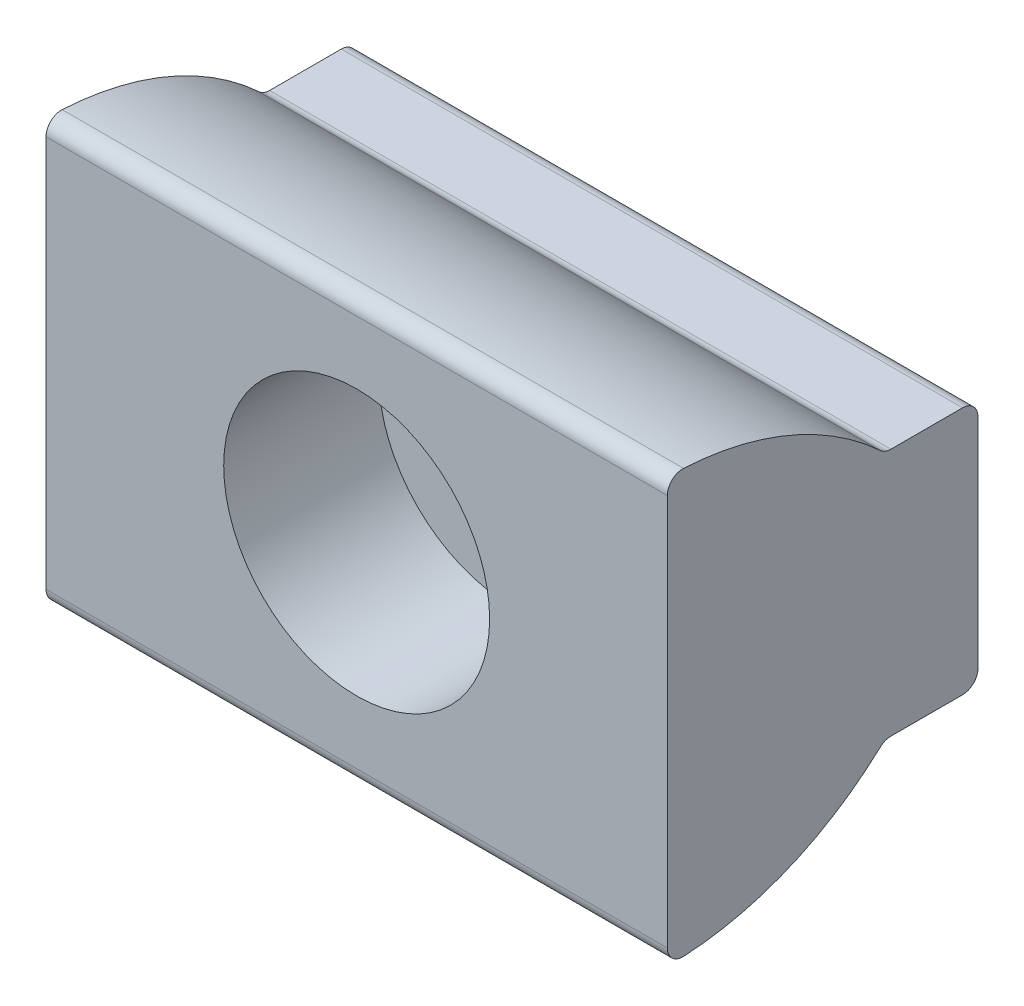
ISO-10303-21;
HEADER;
FILE_DESCRIPTION(('STEP AP214'),'2;1');
FILE_NAME('part.step','',(''),(''),'','','');
FILE_SCHEMA(('AUTOMOTIVE_DESIGN { 1 0 10303 214 1 1 1 1 }'));
ENDSEC;
DATA;
#1=APPLICATION_CONTEXT('core data for automotive mechanical design processes');
#2=APPLICATION_PROTOCOL_DEFINITION('international standard','automotive_design',2000,#1);
#3=PRODUCT_CONTEXT('',#1,'mechanical');
#4=PRODUCT('Part','Part','',(#3));
#5=PRODUCT_RELATED_PRODUCT_CATEGORY('part','',(#4));
#6=PRODUCT_DEFINITION_FORMATION('','',#4);
#7=PRODUCT_DEFINITION_CONTEXT('part definition',#1,'design');
#8=PRODUCT_DEFINITION('design','',#6,#7);
#9=PRODUCT_DEFINITION_SHAPE('','',#8);
#10=(LENGTH_UNIT() NAMED_UNIT(*) SI_UNIT(.MILLI.,.METRE.));
#11=(NAMED_UNIT(*) PLANE_ANGLE_UNIT() SI_UNIT($,.RADIAN.));
#12=(NAMED_UNIT(*) SI_UNIT($,.STERADIAN.) SOLID_ANGLE_UNIT());
#13=UNCERTAINTY_MEASURE_WITH_UNIT(LENGTH_MEASURE(1.E-05),#10,'distance_accuracy_value','');
#14=(GEOMETRIC_REPRESENTATION_CONTEXT(3) GLOBAL_UNCERTAINTY_ASSIGNED_CONTEXT((#13)) GLOBAL_UNIT_ASSIGNED_CONTEXT((#10,
#11,#12)) REPRESENTATION_CONTEXT('',''));
#15=CARTESIAN_POINT('',(0.,0.,0.));
#16=DIRECTION('',(0.,0.,1.));
#17=DIRECTION('',(1.,0.,0.));
#18=AXIS2_PLACEMENT_3D('',#15,#16,#17);
#19=CARTESIAN_POINT('',(15.875,-5.5626,0.));
#20=DIRECTION('',(0.,0.,1.));
#21=DIRECTION('',(1.,0.,0.));
#22=AXIS2_PLACEMENT_3D('',#19,#20,#21);
#23=PLANE('',#22);
#24=DIRECTION('',(0.,1.,0.));
#25=VECTOR('',#24,1.);
#26=CARTESIAN_POINT('',(-15.875,-5.5626,0.));
#27=LINE('',#26,#25);
#28=CARTESIAN_POINT('',(-15.875,-5.5626,0.));
#29=VERTEX_POINT('',#28);
#30=CARTESIAN_POINT('',(-15.875,5.5626,0.));
#31=VERTEX_POINT('',#30);
#32=EDGE_CURVE('E135',#29,#31,#27,.T.);
#33=ORIENTED_EDGE('',*,*,#32,.T.);
#34=DIRECTION('',(-1.,0.,0.));
#35=VECTOR('',#34,1.);
#36=CARTESIAN_POINT('',(15.875,5.5626,0.));
#37=LINE('',#36,#35);
#38=CARTESIAN_POINT('',(15.875,5.5626,0.));
#39=VERTEX_POINT('',#38);
#40=EDGE_CURVE('E186',#39,#31,#37,.T.);
#41=ORIENTED_EDGE('',*,*,#40,.F.);
#42=DIRECTION('',(0.,1.,0.));
#43=VECTOR('',#42,1.);
#44=CARTESIAN_POINT('',(15.875,-5.5626,0.));
#45=LINE('',#44,#43);
#46=CARTESIAN_POINT('',(15.875,-5.5626,0.));
#47=VERTEX_POINT('',#46);
#48=EDGE_CURVE('E158',#47,#39,#45,.T.);
#49=ORIENTED_EDGE('',*,*,#48,.F.);
#50=DIRECTION('',(-1.,0.,0.));
#51=VECTOR('',#50,1.);
#52=CARTESIAN_POINT('',(15.875,-5.5626,0.));
#53=LINE('',#52,#51);
#54=EDGE_CURVE('E189',#47,#29,#53,.T.);
#55=ORIENTED_EDGE('',*,*,#54,.T.);
#56=EDGE_LOOP('',(#33,#41,#49,#55));
#57=FACE_BOUND('',#56,.T.);
#58=CARTESIAN_POINT('',(0.,0.,0.));
#59=DIRECTION('',(0.,0.,1.));
#60=DIRECTION('',(1.,0.,0.));
#61=AXIS2_PLACEMENT_3D('',#58,#59,#60);
#62=CIRCLE('',#61,4.1656);
#63=CARTESIAN_POINT('',(4.1656,0.,0.));
#64=VERTEX_POINT('',#63);
#65=EDGE_CURVE('E18',#64,#64,#62,.F.);
#66=ORIENTED_EDGE('',*,*,#65,.F.);
#67=EDGE_LOOP('',(#66));
#68=FACE_BOUND('',#67,.T.);
#69=ADVANCED_FACE('F14',(#57,#68),#23,.F.);
#70=CARTESIAN_POINT('',(15.875,-10.0126712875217,15.875));
#71=DIRECTION('',(0.,0.,-1.));
#72=DIRECTION('',(-1.,0.,0.));
#73=AXIS2_PLACEMENT_3D('',#70,#71,#72);
#74=PLANE('',#73);
#75=DIRECTION('',(0.,-1.,0.));
#76=VECTOR('',#75,1.);
#77=CARTESIAN_POINT('',(-15.875,-10.0126712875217,15.875));
#78=LINE('',#77,#76);
#79=CARTESIAN_POINT('',(-15.875,10.0126712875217,15.875));
#80=VERTEX_POINT('',#79);
#81=CARTESIAN_POINT('',(-15.875,-10.0126712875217,15.875));
#82=VERTEX_POINT('',#81);
#83=EDGE_CURVE('E147',#80,#82,#78,.T.);
#84=ORIENTED_EDGE('',*,*,#83,.T.);
#85=DIRECTION('',(-1.,0.,0.));
#86=VECTOR('',#85,1.);
#87=CARTESIAN_POINT('',(15.875,-10.0126712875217,15.875));
#88=LINE('',#87,#86);
#89=CARTESIAN_POINT('',(15.875,-10.0126712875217,15.875));
#90=VERTEX_POINT('',#89);
#91=EDGE_CURVE('E122',#90,#82,#88,.T.);
#92=ORIENTED_EDGE('',*,*,#91,.F.);
#93=DIRECTION('',(0.,-1.,0.));
#94=VECTOR('',#93,1.);
#95=CARTESIAN_POINT('',(15.875,-10.0126712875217,15.875));
#96=LINE('',#95,#94);
#97=CARTESIAN_POINT('',(15.875,10.0126712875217,15.875));
#98=VERTEX_POINT('',#97);
#99=EDGE_CURVE('E31',#98,#90,#96,.T.);
#100=ORIENTED_EDGE('',*,*,#99,.F.);
#101=DIRECTION('',(-1.,0.,0.));
#102=VECTOR('',#101,1.);
#103=CARTESIAN_POINT('',(15.875,10.0126712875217,15.875));
#104=LINE('',#103,#102);
#105=EDGE_CURVE('E171',#98,#80,#104,.T.);
#106=ORIENTED_EDGE('',*,*,#105,.T.);
#107=EDGE_LOOP('',(#84,#92,#100,#106));
#108=FACE_BOUND('',#107,.T.);
#109=CARTESIAN_POINT('',(0.,0.,15.875));
#110=DIRECTION('',(0.,0.,-1.));
#111=DIRECTION('',(-1.,0.,0.));
#112=AXIS2_PLACEMENT_3D('',#109,#110,#111);
#113=CIRCLE('',#112,6.7945);
#114=CARTESIAN_POINT('',(-6.7945,0.,15.875));
#115=VERTEX_POINT('',#114);
#116=EDGE_CURVE('E125',#115,#115,#113,.F.);
#117=ORIENTED_EDGE('',*,*,#116,.F.);
#118=EDGE_LOOP('',(#117));
#119=FACE_BOUND('',#118,.T.);
#120=ADVANCED_FACE('F224',(#108,#119),#74,.F.);
#121=CARTESIAN_POINT('',(15.875,-10.0126712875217,15.0876));
#122=DIRECTION('',(-1.,0.,0.));
#123=DIRECTION('',(0.,-1.,0.));
#124=AXIS2_PLACEMENT_3D('',#121,#122,#123);
#125=CYLINDRICAL_SURFACE('',#124,0.7874);
#126=CARTESIAN_POINT('',(-15.875,-10.0126712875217,15.0876));
#127=DIRECTION('',(1.,0.,0.));
#128=DIRECTION('',(0.,-1.,0.));
#129=AXIS2_PLACEMENT_3D('',#126,#127,#128);
#130=CIRCLE('',#129,0.7874);
#131=CARTESIAN_POINT('',(-15.875,-10.7990223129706,15.0469696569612));
#132=VERTEX_POINT('',#131);
#133=EDGE_CURVE('E109',#82,#132,#130,.T.);
#134=ORIENTED_EDGE('',*,*,#133,.T.);
#135=DIRECTION('',(-1.,0.,0.));
#136=VECTOR('',#135,1.);
#137=CARTESIAN_POINT('',(15.875,-10.7990223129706,15.0469696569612));
#138=LINE('',#137,#136);
#139=CARTESIAN_POINT('',(15.875,-10.7990223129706,15.0469696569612));
#140=VERTEX_POINT('',#139);
#141=EDGE_CURVE('E9',#140,#132,#138,.T.);
#142=ORIENTED_EDGE('',*,*,#141,.F.);
#143=CARTESIAN_POINT('',(15.875,-10.0126712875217,15.0876));
#144=DIRECTION('',(1.,0.,0.));
#145=DIRECTION('',(0.,-1.,0.));
#146=AXIS2_PLACEMENT_3D('',#143,#144,#145);
#147=CIRCLE('',#146,0.7874);
#148=EDGE_CURVE('E149',#90,#140,#147,.T.);
#149=ORIENTED_EDGE('',*,*,#148,.F.);
#150=ORIENTED_EDGE('',*,*,#91,.T.);
#151=EDGE_LOOP('',(#134,#142,#149,#150));
#152=FACE_BOUND('',#151,.T.);
#153=ADVANCED_FACE('F16',(#152),#125,.T.);
#154=CARTESIAN_POINT('',(15.875,5.22650099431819,15.875));
#155=DIRECTION('',(-1.,0.,0.));
#156=DIRECTION('',(0.,-1.,0.));
#157=AXIS2_PLACEMENT_3D('',#154,#155,#156);
#158=CYLINDRICAL_SURFACE('',#157,16.0469009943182);
#159=CARTESIAN_POINT('',(-15.875,5.22650099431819,15.875));
#160=DIRECTION('',(1.,0.,0.));
#161=DIRECTION('',(0.,1.,0.));
#162=AXIS2_PLACEMENT_3D('',#159,#160,#161);
#163=CIRCLE('',#162,16.0469009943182);
#164=CARTESIAN_POINT('',(-15.875,-6.55909647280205,4.98451223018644));
#165=VERTEX_POINT('',#164);
#166=EDGE_CURVE('E105',#132,#165,#163,.T.);
#167=ORIENTED_EDGE('',*,*,#166,.T.);
#168=DIRECTION('',(-1.,0.,0.));
#169=VECTOR('',#168,1.);
#170=CARTESIAN_POINT('',(15.875,-6.55909647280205,4.98451223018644));
#171=LINE('',#170,#169);
#172=CARTESIAN_POINT('',(15.875,-6.55909647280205,4.98451223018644));
#173=VERTEX_POINT('',#172);
#174=EDGE_CURVE('E23',#173,#165,#171,.T.);
#175=ORIENTED_EDGE('',*,*,#174,.F.);
#176=CARTESIAN_POINT('',(15.875,5.22650099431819,15.875));
#177=DIRECTION('',(1.,0.,0.));
#178=DIRECTION('',(0.,1.,0.));
#179=AXIS2_PLACEMENT_3D('',#176,#177,#178);
#180=CIRCLE('',#179,16.0469009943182);
#181=EDGE_CURVE('E118',#140,#173,#180,.T.);
#182=ORIENTED_EDGE('',*,*,#181,.F.);
#183=ORIENTED_EDGE('',*,*,#141,.T.);
#184=EDGE_LOOP('',(#167,#175,#182,#183));
#185=FACE_BOUND('',#184,.T.);
#186=ADVANCED_FACE('F117',(#185),#158,.T.);
#187=CARTESIAN_POINT('',(15.875,-7.1374,4.45013054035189));
#188=DIRECTION('',(-1.,0.,0.));
#189=DIRECTION('',(0.,-1.,0.));
#190=AXIS2_PLACEMENT_3D('',#187,#188,#189);
#191=CYLINDRICAL_SURFACE('',#190,0.7874);
#192=CARTESIAN_POINT('',(-15.875,-7.1374,4.45013054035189));
#193=DIRECTION('',(-1.,0.,0.));
#194=DIRECTION('',(0.,-1.,0.));
#195=AXIS2_PLACEMENT_3D('',#192,#193,#194);
#196=CIRCLE('',#195,0.7874);
#197=CARTESIAN_POINT('',(-15.875,-6.35,4.45013054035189));
#198=VERTEX_POINT('',#197);
#199=EDGE_CURVE('E111',#165,#198,#196,.T.);
#200=ORIENTED_EDGE('',*,*,#199,.T.);
#201=DIRECTION('',(-1.,0.,0.));
#202=VECTOR('',#201,1.);
#203=CARTESIAN_POINT('',(15.875,-6.35,4.45013054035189));
#204=LINE('',#203,#202);
#205=CARTESIAN_POINT('',(15.875,-6.35,4.45013054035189));
#206=VERTEX_POINT('',#205);
#207=EDGE_CURVE('E195',#206,#198,#204,.T.);
#208=ORIENTED_EDGE('',*,*,#207,.F.);
#209=CARTESIAN_POINT('',(15.875,-7.1374,4.45013054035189));
#210=DIRECTION('',(-1.,0.,0.));
#211=DIRECTION('',(0.,-1.,0.));
#212=AXIS2_PLACEMENT_3D('',#209,#210,#211);
#213=CIRCLE('',#212,0.7874);
#214=EDGE_CURVE('E152',#173,#206,#213,.T.);
#215=ORIENTED_EDGE('',*,*,#214,.F.);
#216=ORIENTED_EDGE('',*,*,#174,.T.);
#217=EDGE_LOOP('',(#200,#208,#215,#216));
#218=FACE_BOUND('',#217,.T.);
#219=ADVANCED_FACE('F245',(#218),#191,.F.);
#220=CARTESIAN_POINT('',(15.875,-6.35,0.7874));
#221=DIRECTION('',(0.,1.,0.));
#222=DIRECTION('',(-1.,0.,0.));
#223=AXIS2_PLACEMENT_3D('',#220,#221,#222);
#224=PLANE('',#223);
#225=DIRECTION('',(0.,0.,-1.));
#226=VECTOR('',#225,1.);
#227=CARTESIAN_POINT('',(-15.875,-6.35,0.7874));
#228=LINE('',#227,#226);
#229=CARTESIAN_POINT('',(-15.875,-6.35,0.7874));
#230=VERTEX_POINT('',#229);
#231=EDGE_CURVE('E131',#198,#230,#228,.T.);
#232=ORIENTED_EDGE('',*,*,#231,.T.);
#233=DIRECTION('',(-1.,0.,0.));
#234=VECTOR('',#233,1.);
#235=CARTESIAN_POINT('',(15.875,-6.35,0.7874));
#236=LINE('',#235,#234);
#237=CARTESIAN_POINT('',(15.875,-6.35,0.7874));
#238=VERTEX_POINT('',#237);
#239=EDGE_CURVE('E192',#238,#230,#236,.T.);
#240=ORIENTED_EDGE('',*,*,#239,.F.);
#241=DIRECTION('',(0.,0.,-1.));
#242=VECTOR('',#241,1.);
#243=CARTESIAN_POINT('',(15.875,-6.35,0.7874));
#244=LINE('',#243,#242);
#245=EDGE_CURVE('E154',#206,#238,#244,.T.);
#246=ORIENTED_EDGE('',*,*,#245,.F.);
#247=ORIENTED_EDGE('',*,*,#207,.T.);
#248=EDGE_LOOP('',(#232,#240,#246,#247));
#249=FACE_BOUND('',#248,.T.);
#250=ADVANCED_FACE('F241',(#249),#224,.F.);
#251=CARTESIAN_POINT('',(15.875,-5.5626,0.7874));
#252=DIRECTION('',(-1.,0.,0.));
#253=DIRECTION('',(0.,-1.,0.));
#254=AXIS2_PLACEMENT_3D('',#251,#252,#253);
#255=CYLINDRICAL_SURFACE('',#254,0.7874);
#256=CARTESIAN_POINT('',(-15.875,-5.5626,0.7874));
#257=DIRECTION('',(1.,0.,0.));
#258=DIRECTION('',(0.,1.,0.));
#259=AXIS2_PLACEMENT_3D('',#256,#257,#258);
#260=CIRCLE('',#259,0.7874);
#261=EDGE_CURVE('E133',#230,#29,#260,.T.);
#262=ORIENTED_EDGE('',*,*,#261,.T.);
#263=ORIENTED_EDGE('',*,*,#54,.F.);
#264=CARTESIAN_POINT('',(15.875,-5.5626,0.7874));
#265=DIRECTION('',(1.,0.,0.));
#266=DIRECTION('',(0.,1.,0.));
#267=AXIS2_PLACEMENT_3D('',#264,#265,#266);
#268=CIRCLE('',#267,0.7874);
#269=EDGE_CURVE('E156',#238,#47,#268,.T.);
#270=ORIENTED_EDGE('',*,*,#269,.F.);
#271=ORIENTED_EDGE('',*,*,#239,.T.);
#272=EDGE_LOOP('',(#262,#263,#270,#271));
#273=FACE_BOUND('',#272,.T.);
#274=ADVANCED_FACE('F238',(#273),#255,.T.);
#275=CARTESIAN_POINT('',(15.875,5.5626,0.7874));
#276=DIRECTION('',(-1.,0.,0.));
#277=DIRECTION('',(0.,-1.,0.));
#278=AXIS2_PLACEMENT_3D('',#275,#276,#277);
#279=CYLINDRICAL_SURFACE('',#278,0.7874);
#280=CARTESIAN_POINT('',(-15.875,5.5626,0.7874));
#281=DIRECTION('',(1.,0.,0.));
#282=DIRECTION('',(0.,1.,0.));
#283=AXIS2_PLACEMENT_3D('',#280,#281,#282);
#284=CIRCLE('',#283,0.7874);
#285=CARTESIAN_POINT('',(-15.875,6.35,0.7874));
#286=VERTEX_POINT('',#285);
#287=EDGE_CURVE('E137',#31,#286,#284,.T.);
#288=ORIENTED_EDGE('',*,*,#287,.T.);
#289=DIRECTION('',(-1.,0.,0.));
#290=VECTOR('',#289,1.);
#291=CARTESIAN_POINT('',(15.875,6.35,0.7874));
#292=LINE('',#291,#290);
#293=CARTESIAN_POINT('',(15.875,6.35,0.7874));
#294=VERTEX_POINT('',#293);
#295=EDGE_CURVE('E183',#294,#286,#292,.T.);
#296=ORIENTED_EDGE('',*,*,#295,.F.);
#297=CARTESIAN_POINT('',(15.875,5.5626,0.7874));
#298=DIRECTION('',(1.,0.,0.));
#299=DIRECTION('',(0.,1.,0.));
#300=AXIS2_PLACEMENT_3D('',#297,#298,#299);
#301=CIRCLE('',#300,0.7874);
#302=EDGE_CURVE('E160',#39,#294,#301,.T.);
#303=ORIENTED_EDGE('',*,*,#302,.F.);
#304=ORIENTED_EDGE('',*,*,#40,.T.);
#305=EDGE_LOOP('',(#288,#296,#303,#304));
#306=FACE_BOUND('',#305,.T.);
#307=ADVANCED_FACE('F236',(#306),#279,.T.);
#308=CARTESIAN_POINT('',(15.875,6.35,0.7874));
#309=DIRECTION('',(0.,-1.,0.));
#310=DIRECTION('',(1.,0.,0.));
#311=AXIS2_PLACEMENT_3D('',#308,#309,#310);
#312=PLANE('',#311);
#313=DIRECTION('',(0.,0.,1.));
#314=VECTOR('',#313,1.);
#315=CARTESIAN_POINT('',(-15.875,6.35,0.7874));
#316=LINE('',#315,#314);
#317=CARTESIAN_POINT('',(-15.875,6.35,4.45013054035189));
#318=VERTEX_POINT('',#317);
#319=EDGE_CURVE('E139',#286,#318,#316,.T.);
#320=ORIENTED_EDGE('',*,*,#319,.T.);
#321=DIRECTION('',(-1.,0.,0.));
#322=VECTOR('',#321,1.);
#323=CARTESIAN_POINT('',(15.875,6.35,4.45013054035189));
#324=LINE('',#323,#322);
#325=CARTESIAN_POINT('',(15.875,6.35,4.45013054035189));
#326=VERTEX_POINT('',#325);
#327=EDGE_CURVE('E180',#326,#318,#324,.T.);
#328=ORIENTED_EDGE('',*,*,#327,.F.);
#329=DIRECTION('',(0.,0.,1.));
#330=VECTOR('',#329,1.);
#331=CARTESIAN_POINT('',(15.875,6.35,0.7874));
#332=LINE('',#331,#330);
#333=EDGE_CURVE('E162',#294,#326,#332,.T.);
#334=ORIENTED_EDGE('',*,*,#333,.F.);
#335=ORIENTED_EDGE('',*,*,#295,.T.);
#336=EDGE_LOOP('',(#320,#328,#334,#335));
#337=FACE_BOUND('',#336,.T.);
#338=ADVANCED_FACE('F303',(#337),#312,.F.);
#339=CARTESIAN_POINT('',(15.875,7.1374,4.45013054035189));
#340=DIRECTION('',(-1.,0.,0.));
#341=DIRECTION('',(0.,-1.,0.));
#342=AXIS2_PLACEMENT_3D('',#339,#340,#341);
#343=CYLINDRICAL_SURFACE('',#342,0.7874);
#344=CARTESIAN_POINT('',(-15.875,7.1374,4.45013054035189));
#345=DIRECTION('',(-1.,0.,0.));
#346=DIRECTION('',(0.,-1.,0.));
#347=AXIS2_PLACEMENT_3D('',#344,#345,#346);
#348=CIRCLE('',#347,0.7874);
#349=CARTESIAN_POINT('',(-15.875,6.55909647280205,4.98451223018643));
#350=VERTEX_POINT('',#349);
#351=EDGE_CURVE('E141',#318,#350,#348,.T.);
#352=ORIENTED_EDGE('',*,*,#351,.T.);
#353=DIRECTION('',(-1.,0.,0.));
#354=VECTOR('',#353,1.);
#355=CARTESIAN_POINT('',(15.875,6.55909647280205,4.98451223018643));
#356=LINE('',#355,#354);
#357=CARTESIAN_POINT('',(15.875,6.55909647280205,4.98451223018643));
#358=VERTEX_POINT('',#357);
#359=EDGE_CURVE('E177',#358,#350,#356,.T.);
#360=ORIENTED_EDGE('',*,*,#359,.F.);
#361=CARTESIAN_POINT('',(15.875,7.1374,4.45013054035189));
#362=DIRECTION('',(-1.,0.,0.));
#363=DIRECTION('',(0.,-1.,0.));
#364=AXIS2_PLACEMENT_3D('',#361,#362,#363);
#365=CIRCLE('',#364,0.7874);
#366=EDGE_CURVE('E164',#326,#358,#365,.T.);
#367=ORIENTED_EDGE('',*,*,#366,.F.);
#368=ORIENTED_EDGE('',*,*,#327,.T.);
#369=EDGE_LOOP('',(#352,#360,#367,#368));
#370=FACE_BOUND('',#369,.T.);
#371=ADVANCED_FACE('F310',(#370),#343,.F.);
#372=CARTESIAN_POINT('',(15.875,-5.22650099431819,15.875));
#373=DIRECTION('',(-1.,0.,0.));
#374=DIRECTION('',(0.,-1.,0.));
#375=AXIS2_PLACEMENT_3D('',#372,#373,#374);
#376=CYLINDRICAL_SURFACE('',#375,16.0469009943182);
#377=CARTESIAN_POINT('',(-15.875,-5.22650099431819,15.875));
#378=DIRECTION('',(1.,0.,0.));
#379=DIRECTION('',(0.,-1.,0.));
#380=AXIS2_PLACEMENT_3D('',#377,#378,#379);
#381=CIRCLE('',#380,16.0469009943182);
#382=CARTESIAN_POINT('',(-15.875,10.7990223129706,15.0469696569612));
#383=VERTEX_POINT('',#382);
#384=EDGE_CURVE('E143',#350,#383,#381,.T.);
#385=ORIENTED_EDGE('',*,*,#384,.T.);
#386=DIRECTION('',(-1.,0.,0.));
#387=VECTOR('',#386,1.);
#388=CARTESIAN_POINT('',(15.875,10.7990223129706,15.0469696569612));
#389=LINE('',#388,#387);
#390=CARTESIAN_POINT('',(15.875,10.7990223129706,15.0469696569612));
#391=VERTEX_POINT('',#390);
#392=EDGE_CURVE('E174',#391,#383,#389,.T.);
#393=ORIENTED_EDGE('',*,*,#392,.F.);
#394=CARTESIAN_POINT('',(15.875,-5.22650099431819,15.875));
#395=DIRECTION('',(1.,0.,0.));
#396=DIRECTION('',(0.,-1.,0.));
#397=AXIS2_PLACEMENT_3D('',#394,#395,#396);
#398=CIRCLE('',#397,16.0469009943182);
#399=EDGE_CURVE('E166',#358,#391,#398,.T.);
#400=ORIENTED_EDGE('',*,*,#399,.F.);
#401=ORIENTED_EDGE('',*,*,#359,.T.);
#402=EDGE_LOOP('',(#385,#393,#400,#401));
#403=FACE_BOUND('',#402,.T.);
#404=ADVANCED_FACE('F318',(#403),#376,.T.);
#405=CARTESIAN_POINT('',(15.875,10.0126712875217,15.0876));
#406=DIRECTION('',(-1.,0.,0.));
#407=DIRECTION('',(0.,-1.,0.));
#408=AXIS2_PLACEMENT_3D('',#405,#406,#407);
#409=CYLINDRICAL_SURFACE('',#408,0.7874);
#410=CARTESIAN_POINT('',(-15.875,10.0126712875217,15.0876));
#411=DIRECTION('',(1.,0.,0.));
#412=DIRECTION('',(0.,-1.,0.));
#413=AXIS2_PLACEMENT_3D('',#410,#411,#412);
#414=CIRCLE('',#413,0.7874);
#415=EDGE_CURVE('E145',#383,#80,#414,.T.);
#416=ORIENTED_EDGE('',*,*,#415,.T.);
#417=ORIENTED_EDGE('',*,*,#105,.F.);
#418=CARTESIAN_POINT('',(15.875,10.0126712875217,15.0876));
#419=DIRECTION('',(1.,0.,0.));
#420=DIRECTION('',(0.,-1.,0.));
#421=AXIS2_PLACEMENT_3D('',#418,#419,#420);
#422=CIRCLE('',#421,0.7874);
#423=EDGE_CURVE('E36',#391,#98,#422,.T.);
#424=ORIENTED_EDGE('',*,*,#423,.F.);
#425=ORIENTED_EDGE('',*,*,#392,.T.);
#426=EDGE_LOOP('',(#416,#417,#424,#425));
#427=FACE_BOUND('',#426,.T.);
#428=ADVANCED_FACE('F327',(#427),#409,.T.);
#429=CARTESIAN_POINT('',(15.875,-10.0126712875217,15.0876));
#430=DIRECTION('',(-1.,0.,0.));
#431=DIRECTION('',(0.,-1.,0.));
#432=AXIS2_PLACEMENT_3D('',#429,#430,#431);
#433=PLANE('',#432);
#434=ORIENTED_EDGE('',*,*,#148,.T.);
#435=ORIENTED_EDGE('',*,*,#181,.T.);
#436=ORIENTED_EDGE('',*,*,#214,.T.);
#437=ORIENTED_EDGE('',*,*,#245,.T.);
#438=ORIENTED_EDGE('',*,*,#269,.T.);
#439=ORIENTED_EDGE('',*,*,#48,.T.);
#440=ORIENTED_EDGE('',*,*,#302,.T.);
#441=ORIENTED_EDGE('',*,*,#333,.T.);
#442=ORIENTED_EDGE('',*,*,#366,.T.);
#443=ORIENTED_EDGE('',*,*,#399,.T.);
#444=ORIENTED_EDGE('',*,*,#423,.T.);
#445=ORIENTED_EDGE('',*,*,#99,.T.);
#446=EDGE_LOOP('',(#434,#435,#436,#437,#438,#439,#440,#441,#442,#443,#444,#445));
#447=FACE_BOUND('',#446,.T.);
#448=ADVANCED_FACE('F336',(#447),#433,.F.);
#449=CARTESIAN_POINT('',(-15.875,-10.0126712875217,15.0876));
#450=DIRECTION('',(-1.,0.,0.));
#451=DIRECTION('',(0.,-1.,0.));
#452=AXIS2_PLACEMENT_3D('',#449,#450,#451);
#453=PLANE('',#452);
#454=ORIENTED_EDGE('',*,*,#133,.F.);
#455=ORIENTED_EDGE('',*,*,#83,.F.);
#456=ORIENTED_EDGE('',*,*,#415,.F.);
#457=ORIENTED_EDGE('',*,*,#384,.F.);
#458=ORIENTED_EDGE('',*,*,#351,.F.);
#459=ORIENTED_EDGE('',*,*,#319,.F.);
#460=ORIENTED_EDGE('',*,*,#287,.F.);
#461=ORIENTED_EDGE('',*,*,#32,.F.);
#462=ORIENTED_EDGE('',*,*,#261,.F.);
#463=ORIENTED_EDGE('',*,*,#231,.F.);
#464=ORIENTED_EDGE('',*,*,#199,.F.);
#465=ORIENTED_EDGE('',*,*,#166,.F.);
#466=EDGE_LOOP('',(#454,#455,#456,#457,#458,#459,#460,#461,#462,#463,#464,#465));
#467=FACE_BOUND('',#466,.T.);
#468=ADVANCED_FACE('F106',(#467),#453,.T.);
#469=CARTESIAN_POINT('',(0.,0.,25.2235199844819));
#470=DIRECTION('',(0.,0.,1.));
#471=DIRECTION('',(1.,0.,0.));
#472=AXIS2_PLACEMENT_3D('',#469,#470,#471);
#473=CYLINDRICAL_SURFACE('',#472,4.1656);
#474=CARTESIAN_POINT('',(0.,0.,7.9502));
#475=DIRECTION('',(0.,0.,1.));
#476=DIRECTION('',(1.,0.,0.));
#477=AXIS2_PLACEMENT_3D('',#474,#475,#476);
#478=CIRCLE('',#477,4.1656);
#479=CARTESIAN_POINT('',(4.1656,0.,7.9502));
#480=VERTEX_POINT('',#479);
#481=EDGE_CURVE('E127',#480,#480,#478,.T.);
#482=ORIENTED_EDGE('',*,*,#481,.T.);
#483=EDGE_LOOP('',(#482));
#484=FACE_BOUND('',#483,.T.);
#485=ORIENTED_EDGE('',*,*,#65,.T.);
#486=EDGE_LOOP('',(#485));
#487=FACE_BOUND('',#486,.T.);
#488=ADVANCED_FACE('F213',(#484,#487),#473,.F.);
#489=CARTESIAN_POINT('',(0.,0.,25.2235199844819));
#490=DIRECTION('',(0.,0.,1.));
#491=DIRECTION('',(1.,0.,0.));
#492=AXIS2_PLACEMENT_3D('',#489,#490,#491);
#493=CYLINDRICAL_SURFACE('',#492,6.7945);
#494=CARTESIAN_POINT('',(0.,0.,7.9502));
#495=DIRECTION('',(0.,0.,1.));
#496=DIRECTION('',(1.,0.,0.));
#497=AXIS2_PLACEMENT_3D('',#494,#495,#496);
#498=CIRCLE('',#497,6.7945);
#499=CARTESIAN_POINT('',(6.7945,0.,7.9502));
#500=VERTEX_POINT('',#499);
#501=EDGE_CURVE('E202',#500,#500,#498,.T.);
#502=ORIENTED_EDGE('',*,*,#501,.F.);
#503=EDGE_LOOP('',(#502));
#504=FACE_BOUND('',#503,.T.);
#505=ORIENTED_EDGE('',*,*,#116,.T.);
#506=EDGE_LOOP('',(#505));
#507=FACE_BOUND('',#506,.T.);
#508=ADVANCED_FACE('F211',(#504,#507),#493,.F.);
#509=CARTESIAN_POINT('',(0.,4.1656,7.9502));
#510=DIRECTION('',(0.,0.,1.));
#511=DIRECTION('',(1.,0.,0.));
#512=AXIS2_PLACEMENT_3D('',#509,#510,#511);
#513=PLANE('',#512);
#514=ORIENTED_EDGE('',*,*,#501,.T.);
#515=EDGE_LOOP('',(#514));
#516=FACE_BOUND('',#515,.T.);
#517=ORIENTED_EDGE('',*,*,#481,.F.);
#518=EDGE_LOOP('',(#517));
#519=FACE_BOUND('',#518,.T.);
#520=ADVANCED_FACE('F208',(#516,#519),#513,.T.);
#521=CLOSED_SHELL('',(#69,#120,#153,#186,#219,#250,#274,#307,#338,#371,#404,#428,#448,#468,#488,
#508,#520));
#522=MANIFOLD_SOLID_BREP('B1',#521);
#523=ADVANCED_BREP_SHAPE_REPRESENTATION('',(#18,#522),#14);
#524=SHAPE_DEFINITION_REPRESENTATION(#9,#523);
ENDSEC;
END-ISO-10303-21;
